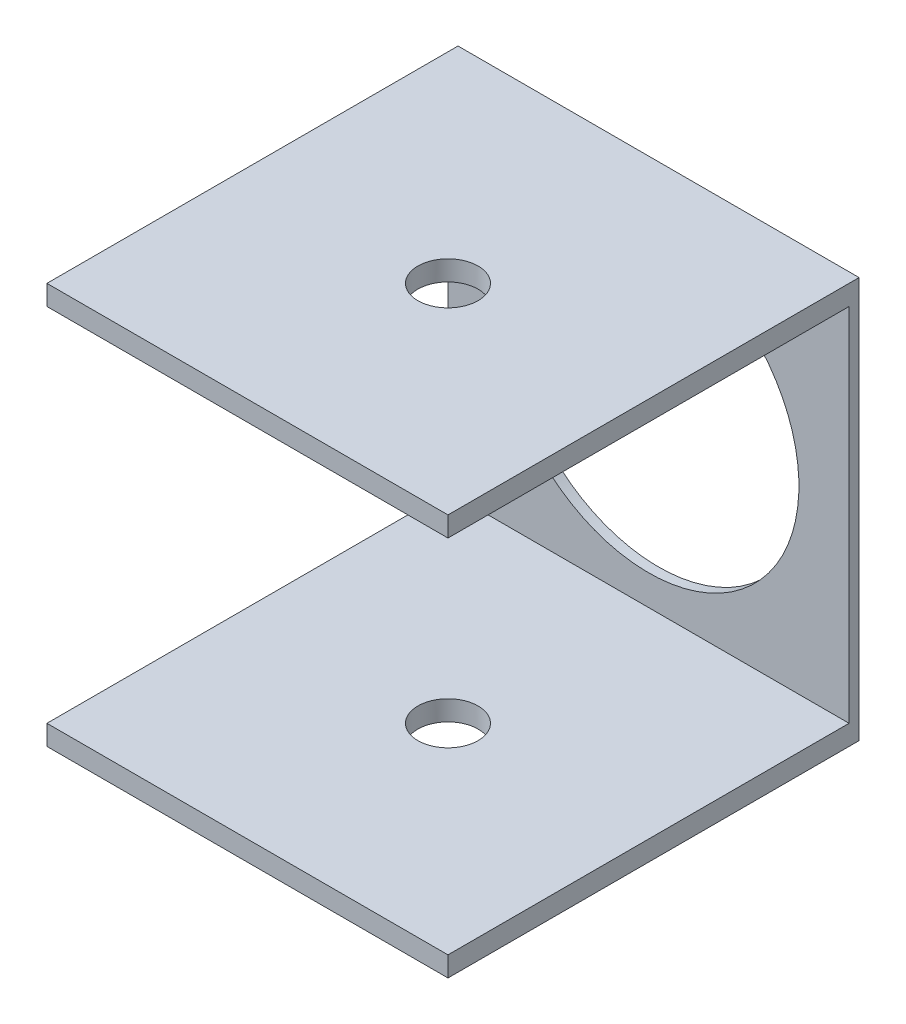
from build123d import *

# Parameters (mm, degrees)
ESQUISSE4_R             = 15
EXTRUSION1_DEPTH        = 1
ESQUISSE5_W             = 40
ESQUISSE5_H             = 40
EXTRUSION2_DEPTH        = 2
ESQUISSE8_W             = 40
ESQUISSE8_H             = 40
EXTRUSION3_DEPTH        = 2
ESQUISSE9_W             = 40
ESQUISSE9_H             = 40
ESQUISSE9_R             = 15
EXTRUSION4_DEPTH        = 1
ESQUISSE10_R            = 15
ENL_V_MAT_EXTRU_1_DEPTH = 1
ESQUISSE12_R            = 3
ENL_V_MAT_EXTRU_2_DEPTH = 61.671245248


with BuildPart() as part:
    # Esquisse4 → Extrusion1 (new body)
    with BuildSketch(Plane.XY):
        Circle(ESQUISSE4_R)
    extrude(amount=EXTRUSION1_DEPTH)



with BuildPart() as body_2:
    # Esquisse5 → Extrusion2 (new body)
    with BuildSketch(Plane(origin=(0, 20, 0), x_dir=(-1, 0, 0), z_dir=(0, 1, 0))):
        with Locations((0, 21)):
            Rectangle(ESQUISSE5_W, ESQUISSE5_H)
    extrude(amount=-EXTRUSION2_DEPTH)


with BuildPart() as body_3:
    # Esquisse8 → Extrusion3 (new body)
    with BuildSketch(Plane(origin=(0, -20, 0), x_dir=(-1, 0, 0), z_dir=(0, 1, 0))):
        with Locations((0, 21)):
            Rectangle(ESQUISSE8_W, ESQUISSE8_H)
    extrude(amount=EXTRUSION3_DEPTH)


with BuildPart() as part_1:
    add(part.part)

    add(body_2.part)  # Extrusion4 merges body 2

    add(body_3.part)  # Extrusion4 merges body 3
    # Esquisse9 → Extrusion4 (add)
    with BuildSketch(Plane(origin=(0, 0, 0), x_dir=(-1, 0, 0), z_dir=(0, 0, -1))):
        Rectangle(ESQUISSE9_W, ESQUISSE9_H)
        Circle(ESQUISSE9_R, mode=Mode.SUBTRACT)
    extrude(amount=-EXTRUSION4_DEPTH)

    # Esquisse10 → Enl_v. mat.-Extru.1 (cut)
    with BuildSketch(Plane(origin=(0, 0, 0), x_dir=(-1, 0, 0), z_dir=(0, 0, -1))):
        Circle(ESQUISSE10_R)
    extrude(amount=-ENL_V_MAT_EXTRU_1_DEPTH, mode=Mode.SUBTRACT)

    # Esquisse12 → Enl_v. mat.-Extru.2 (cut, through all)
    with BuildSketch(Plane(origin=(0, 20, 0), x_dir=(1, 0, 0), z_dir=(0, 1, 0))):
        with Locations(Location((0, -21, 0), (0, 0, 270))):
            Circle(ESQUISSE12_R)
    extrude(amount=-ENL_V_MAT_EXTRU_2_DEPTH, mode=Mode.SUBTRACT)


solid = part_1.part
